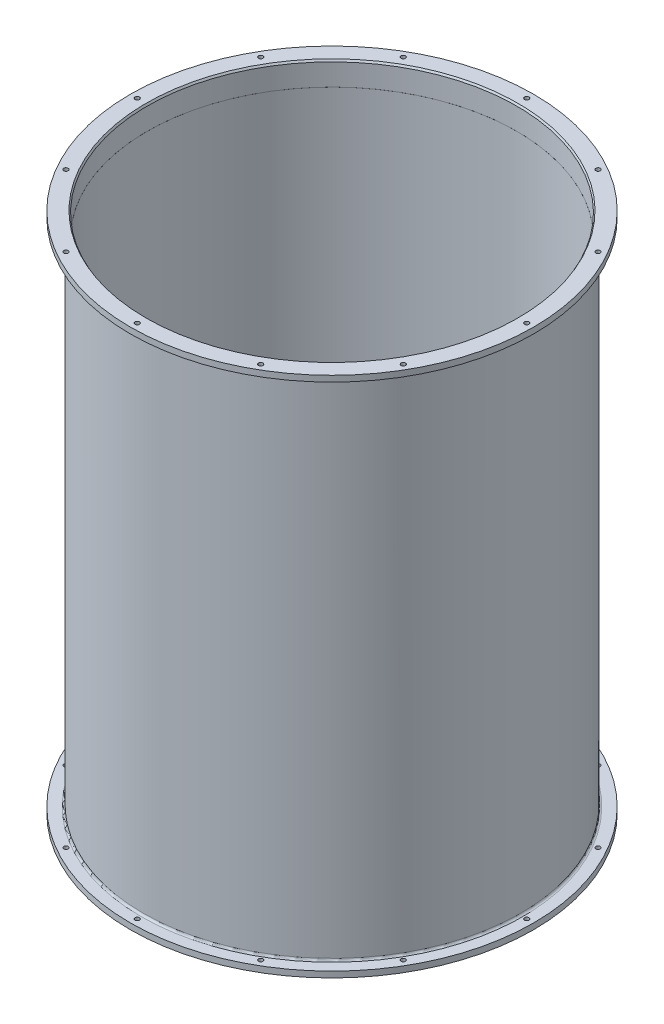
from build123d import *

# Parameters (mm, degrees)
SKETCH2_R          = 3.556
CUT_EXTRUDE1_DEPTH = 956.163276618
CIRPATTERN1_COUNT  = 12
CHAMFER1_SIZE      = 3.048
CHAMFER1_SIZE2     = 1.75976362
FILLET1_R          = 3.175
FILLET2_R          = 3.175
CHAMFER2_SIZE      = 3.048
CHAMFER2_SIZE2     = 1.75976362


with BuildPart() as part:
    # Sketch1 → Revolve1 (revolve)
    with BuildSketch(Plane.XY, mode=Mode.PRIVATE) as revolve1_sk:
        Polygon((-296.8625, 381), (-296.926, 381), (-296.926, 419.1), (-323.85, 419.1), (-323.85, 409.575), (-303.2125, 409.575), (-303.2125, -409.575), (-323.85, -409.575), (-323.85, -419.1), (-296.926, -419.1), (-296.926, -381), (-296.8625, -381), align=None)
    revolve(revolve1_sk.sketch.rotate(Axis((0, 86.36, 0), (0, -1, 0)), 270), axis=Axis((0, 86.36, 0), (0, -1, 0)))

    # Sketch2 → Cut-Extrude1 (cut, through all)
    with BuildSketch(Plane(origin=(0, 419.1, 0), x_dir=(-1, 0, 0), z_dir=(0, 1, 0))):
        with Locations(Location((0, 312.7375, 0), (0, 0, 90))):
            Circle(SKETCH2_R)
    cut_extrude1 = extrude(amount=-CUT_EXTRUDE1_DEPTH, mode=Mode.SUBTRACT)

    # CirPattern1: Cut-Extrude1 ×12 about axis
    cirpattern1_axis = Axis((0, 0, 0), (0, 1, 0))
    for i in range(1, CIRPATTERN1_COUNT):
        add(cut_extrude1.rotate(cirpattern1_axis, i * 360 / CIRPATTERN1_COUNT), mode=Mode.SUBTRACT)

    # Chamfer1
    chamfer1_edges = [part.edges().sort_by_distance(p)[0] for p in [
        (0, -419.1, -296.926),
    ]]
    chamfer1_side = [part.faces().sort_by_distance(p)[0] for p in [
        (0, -400.05, -296.926),
    ]]
    chamfer(chamfer1_edges, length=CHAMFER1_SIZE, length2=CHAMFER1_SIZE2, reference=chamfer1_side[0])

    # Fillet1
    fillet1_edges = [part.edges().sort_by_distance(p)[0] for p in [
        (0, 409.575, -303.2125),
    ]]
    fillet(fillet1_edges, radius=FILLET1_R)

    # Fillet2
    fillet2_edges = [part.edges().sort_by_distance(p)[0] for p in [
        (0, -409.575, -303.2125),
    ]]
    fillet(fillet2_edges, radius=FILLET2_R)

    # Chamfer2
    chamfer2_edges = [part.edges().sort_by_distance(p)[0] for p in [
        (0, 419.1, -296.926),
    ]]
    chamfer2_side = [part.faces().sort_by_distance(p)[0] for p in [
        (0, 400.05, -296.926),
    ]]
    chamfer(chamfer2_edges, length=CHAMFER2_SIZE, length2=CHAMFER2_SIZE2, reference=chamfer2_side[0])


solid = part.part
